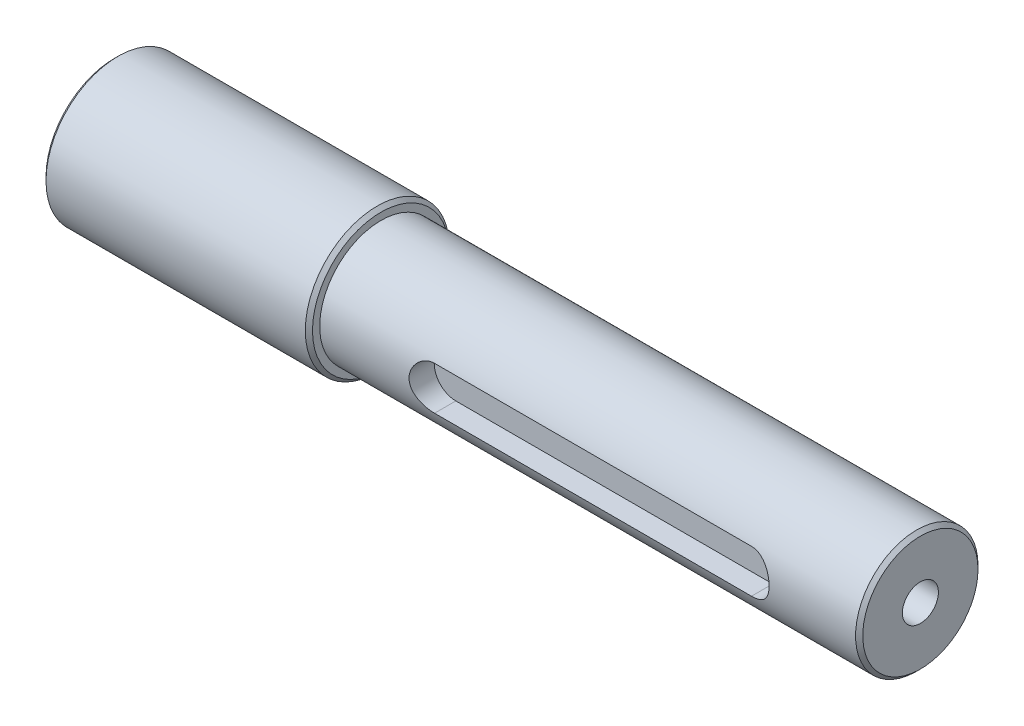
from build123d import *

# Parameters (mm, degrees)
SKETCH1_R                 = 8.5
BOSS_EXTRUDE1_DEPTH       = 74.9
SKETCH2_R                 = 10
BOSS_EXTRUDE2_DEPTH       = 37
M6X1_0_TAPPED_HOLE1_D     = 5
M6X1_0_TAPPED_HOLE1_DEPTH = 30
M6X1_0_TAPPED_HOLE1_TIP   = 1.502151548
CUT_EXTRUDE1_REACH        = 79.039
CUT_EXTRUDE1_END_RADIUS   = 8.5
CHAMFER1_SIZE             = 0.5


with BuildPart() as part:
    # Sketch1 → Boss-Extrude1 (new body)
    with BuildSketch(Plane(origin=(0, 0, 0), x_dir=(0, 0, -1), z_dir=(1, 0, 0))):
        Circle(SKETCH1_R)
    extrude(amount=BOSS_EXTRUDE1_DEPTH)

    # Sketch2 → Boss-Extrude2 (add)
    with BuildSketch(Plane.ZY):
        Circle(SKETCH2_R)
    extrude(amount=BOSS_EXTRUDE2_DEPTH)

    # M6x1.0 Tapped Hole1
    with Locations(Plane(origin=(74.9, 0, 0), x_dir=(0, 0, -1), z_dir=(1, 0, 0))):
        with Locations((0, 0)):
            Hole(M6X1_0_TAPPED_HOLE1_D / 2, depth=M6X1_0_TAPPED_HOLE1_DEPTH)
            with Locations((0, 0, -(M6X1_0_TAPPED_HOLE1_DEPTH + M6X1_0_TAPPED_HOLE1_TIP / 2))):  # 118° drill point
                Cone(0, M6X1_0_TAPPED_HOLE1_D / 2, M6X1_0_TAPPED_HOLE1_TIP, mode=Mode.SUBTRACT)

    # Cut-Extrude1: up to this cylinder (the profile starts inside it)
    cut_extrude1_end = Plane(origin=(37.4, 0, 0), z_dir=(-1, 0, 0)) * Cylinder(CUT_EXTRUDE1_END_RADIUS, 176.078, mode=Mode.PRIVATE)
    # Sketch5 → Cut-Extrude1 (cut, up to the surface)
    with BuildSketch(Plane.XY.offset(5), mode=Mode.PRIVATE) as cut_extrude1_sk1:
        with BuildLine():
            Line((15.4, 3), (59.4, 3))
            ThreePointArc((59.4, 3), (62.4, 0), (59.4, -3))
            Line((59.4, -3), (15.4, -3))
            ThreePointArc((15.4, -3), (12.4, 0), (15.4, 3))
        make_face()
    cut_extrude1_tool1 = extrude(cut_extrude1_sk1.sketch, amount=CUT_EXTRUDE1_REACH, mode=Mode.PRIVATE) & cut_extrude1_end
    add(cut_extrude1_tool1.solids().sort_by_distance((37.4, 0, 5))[0], mode=Mode.SUBTRACT)

    # Chamfer1
    chamfer1_edges = [part.edges().sort_by_distance(p)[0] for p in [
        (74.9, 0, 8.5),
        (0, 0, -10),
        (-37, 0, -10),
    ]]
    chamfer(chamfer1_edges, length=CHAMFER1_SIZE)


solid = part.part
